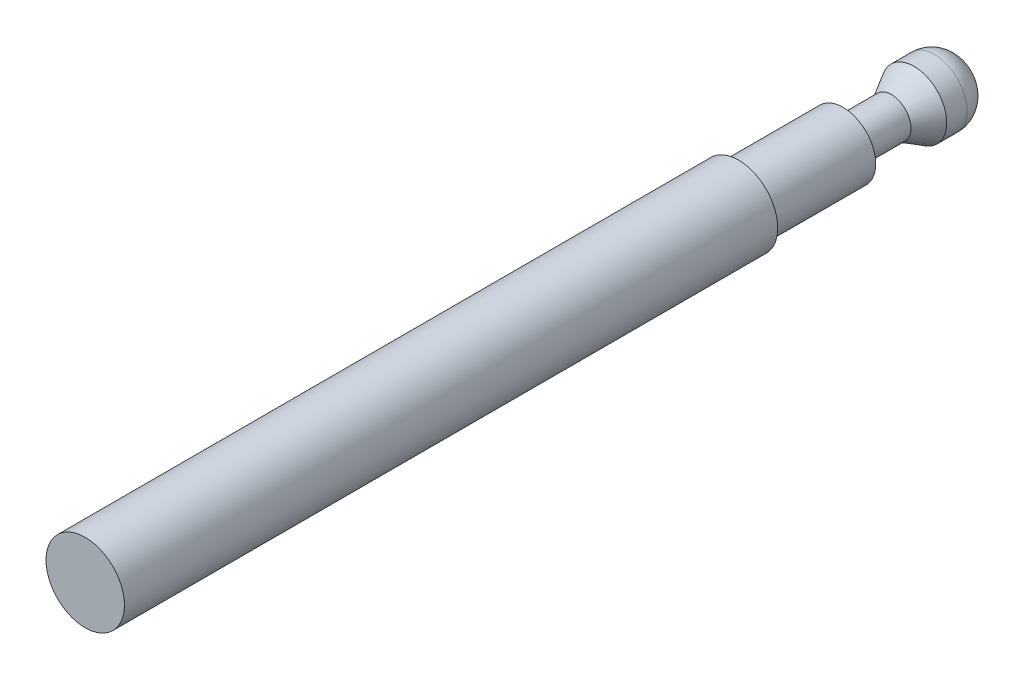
ISO-10303-21;
HEADER;
FILE_DESCRIPTION(('STEP AP214'),'2;1');
FILE_NAME('part.step','',(''),(''),'','','');
FILE_SCHEMA(('AUTOMOTIVE_DESIGN { 1 0 10303 214 1 1 1 1 }'));
ENDSEC;
DATA;
#1=APPLICATION_CONTEXT('core data for automotive mechanical design processes');
#2=APPLICATION_PROTOCOL_DEFINITION('international standard','automotive_design',2000,#1);
#3=PRODUCT_CONTEXT('',#1,'mechanical');
#4=PRODUCT('Part','Part','',(#3));
#5=PRODUCT_RELATED_PRODUCT_CATEGORY('part','',(#4));
#6=PRODUCT_DEFINITION_FORMATION('','',#4);
#7=PRODUCT_DEFINITION_CONTEXT('part definition',#1,'design');
#8=PRODUCT_DEFINITION('design','',#6,#7);
#9=PRODUCT_DEFINITION_SHAPE('','',#8);
#10=(LENGTH_UNIT() NAMED_UNIT(*) SI_UNIT(.MILLI.,.METRE.));
#11=(NAMED_UNIT(*) PLANE_ANGLE_UNIT() SI_UNIT($,.RADIAN.));
#12=(NAMED_UNIT(*) SI_UNIT($,.STERADIAN.) SOLID_ANGLE_UNIT());
#13=UNCERTAINTY_MEASURE_WITH_UNIT(LENGTH_MEASURE(1.E-05),#10,'distance_accuracy_value','');
#14=(GEOMETRIC_REPRESENTATION_CONTEXT(3) GLOBAL_UNCERTAINTY_ASSIGNED_CONTEXT((#13)) GLOBAL_UNIT_ASSIGNED_CONTEXT((#10,
#11,#12)) REPRESENTATION_CONTEXT('',''));
#15=CARTESIAN_POINT('',(0.,0.,0.));
#16=DIRECTION('',(0.,0.,1.));
#17=DIRECTION('',(1.,0.,0.));
#18=AXIS2_PLACEMENT_3D('',#15,#16,#17);
#19=CARTESIAN_POINT('',(0.,0.,-50.));
#20=DIRECTION('',(0.,0.,-1.));
#21=DIRECTION('',(0.,-1.,0.));
#22=AXIS2_PLACEMENT_3D('',#19,#20,#21);
#23=CYLINDRICAL_SURFACE('',#22,1.5);
#24=CARTESIAN_POINT('',(0.,0.,-58.));
#25=DIRECTION('',(0.,0.,-1.));
#26=DIRECTION('',(0.,-1.,0.));
#27=AXIS2_PLACEMENT_3D('',#24,#25,#26);
#28=CIRCLE('',#27,1.5);
#29=CARTESIAN_POINT('',(0.,-1.5,-58.));
#30=VERTEX_POINT('',#29);
#31=EDGE_CURVE('E34',#30,#30,#28,.T.);
#32=ORIENTED_EDGE('',*,*,#31,.T.);
#33=EDGE_LOOP('',(#32));
#34=FACE_BOUND('',#33,.T.);
#35=CARTESIAN_POINT('',(0.,0.,-61.7));
#36=DIRECTION('',(0.,0.,-1.));
#37=DIRECTION('',(0.,-1.,0.));
#38=AXIS2_PLACEMENT_3D('',#35,#36,#37);
#39=CIRCLE('',#38,1.5);
#40=CARTESIAN_POINT('',(0.,-1.5,-61.7));
#41=VERTEX_POINT('',#40);
#42=EDGE_CURVE('E22',#41,#41,#39,.T.);
#43=ORIENTED_EDGE('',*,*,#42,.F.);
#44=EDGE_LOOP('',(#43));
#45=FACE_BOUND('',#44,.T.);
#46=ADVANCED_FACE('F12',(#34,#45),#23,.T.);
#47=CARTESIAN_POINT('',(0.,0.,-63.4320508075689));
#48=DIRECTION('',(0.,0.,-1.));
#49=DIRECTION('',(0.,-1.,0.));
#50=AXIS2_PLACEMENT_3D('',#47,#48,#49);
#51=CONICAL_SURFACE('',#50,2.5,0.523598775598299);
#52=ORIENTED_EDGE('',*,*,#42,.T.);
#53=EDGE_LOOP('',(#52));
#54=FACE_BOUND('',#53,.T.);
#55=CARTESIAN_POINT('',(0.,0.,-63.4320508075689));
#56=DIRECTION('',(0.,0.,-1.));
#57=DIRECTION('',(0.,-1.,0.));
#58=AXIS2_PLACEMENT_3D('',#55,#56,#57);
#59=CIRCLE('',#58,2.5);
#60=CARTESIAN_POINT('',(0.,-2.5,-63.4320508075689));
#61=VERTEX_POINT('',#60);
#62=EDGE_CURVE('E26',#61,#61,#59,.T.);
#63=ORIENTED_EDGE('',*,*,#62,.F.);
#64=EDGE_LOOP('',(#63));
#65=FACE_BOUND('',#64,.T.);
#66=ADVANCED_FACE('F62',(#54,#65),#51,.T.);
#67=CARTESIAN_POINT('',(0.,0.,-50.));
#68=DIRECTION('',(0.,0.,-1.));
#69=DIRECTION('',(0.,-1.,0.));
#70=AXIS2_PLACEMENT_3D('',#67,#68,#69);
#71=CYLINDRICAL_SURFACE('',#70,2.5);
#72=CARTESIAN_POINT('',(0.,0.,-65.));
#73=DIRECTION('',(0.,0.,-1.));
#74=DIRECTION('',(0.,-1.,0.));
#75=AXIS2_PLACEMENT_3D('',#72,#73,#74);
#76=CIRCLE('',#75,2.5);
#77=CARTESIAN_POINT('',(0.,-2.5,-65.));
#78=VERTEX_POINT('',#77);
#79=EDGE_CURVE('E8',#78,#78,#76,.F.);
#80=ORIENTED_EDGE('',*,*,#79,.T.);
#81=EDGE_LOOP('',(#80));
#82=FACE_BOUND('',#81,.T.);
#83=ORIENTED_EDGE('',*,*,#62,.T.);
#84=EDGE_LOOP('',(#83));
#85=FACE_BOUND('',#84,.T.);
#86=ADVANCED_FACE('F68',(#82,#85),#71,.T.);
#87=CARTESIAN_POINT('',(-2.5,0.,-67.));
#88=DIRECTION('',(0.,0.,-1.));
#89=DIRECTION('',(0.,-1.,0.));
#90=AXIS2_PLACEMENT_3D('',#87,#88,#89);
#91=PLANE('',#90);
#92=CARTESIAN_POINT('',(0.,0.,-67.));
#93=DIRECTION('',(0.,0.,-1.));
#94=DIRECTION('',(0.,-1.,0.));
#95=AXIS2_PLACEMENT_3D('',#92,#93,#94);
#96=CIRCLE('',#95,0.5);
#97=CARTESIAN_POINT('',(0.,-0.499999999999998,-67.));
#98=VERTEX_POINT('',#97);
#99=EDGE_CURVE('E18',#98,#98,#96,.T.);
#100=ORIENTED_EDGE('',*,*,#99,.T.);
#101=EDGE_LOOP('',(#100));
#102=FACE_BOUND('',#101,.T.);
#103=ADVANCED_FACE('F77',(#102),#91,.T.);
#104=CARTESIAN_POINT('',(0.,0.,-50.));
#105=DIRECTION('',(0.,0.,-1.));
#106=DIRECTION('',(0.,-1.,0.));
#107=AXIS2_PLACEMENT_3D('',#104,#105,#106);
#108=CYLINDRICAL_SURFACE('',#107,2.5);
#109=CARTESIAN_POINT('',(0.,0.,-50.));
#110=DIRECTION('',(0.,0.,1.));
#111=DIRECTION('',(1.,0.,0.));
#112=AXIS2_PLACEMENT_3D('',#109,#110,#111);
#113=CIRCLE('',#112,2.5);
#114=CARTESIAN_POINT('',(2.5,0.,-50.));
#115=VERTEX_POINT('',#114);
#116=EDGE_CURVE('E37',#115,#115,#113,.F.);
#117=ORIENTED_EDGE('',*,*,#116,.T.);
#118=EDGE_LOOP('',(#117));
#119=FACE_BOUND('',#118,.T.);
#120=CARTESIAN_POINT('',(0.,0.,-58.));
#121=DIRECTION('',(0.,0.,-1.));
#122=DIRECTION('',(0.,-1.,0.));
#123=AXIS2_PLACEMENT_3D('',#120,#121,#122);
#124=CIRCLE('',#123,2.5);
#125=CARTESIAN_POINT('',(0.,-2.5,-58.));
#126=VERTEX_POINT('',#125);
#127=EDGE_CURVE('E31',#126,#126,#124,.T.);
#128=ORIENTED_EDGE('',*,*,#127,.F.);
#129=EDGE_LOOP('',(#128));
#130=FACE_BOUND('',#129,.T.);
#131=ADVANCED_FACE('F83',(#119,#130),#108,.T.);
#132=CARTESIAN_POINT('',(-2.5,0.,-58.));
#133=DIRECTION('',(0.,0.,-1.));
#134=DIRECTION('',(0.,-1.,0.));
#135=AXIS2_PLACEMENT_3D('',#132,#133,#134);
#136=PLANE('',#135);
#137=ORIENTED_EDGE('',*,*,#127,.T.);
#138=EDGE_LOOP('',(#137));
#139=FACE_BOUND('',#138,.T.);
#140=ORIENTED_EDGE('',*,*,#31,.F.);
#141=EDGE_LOOP('',(#140));
#142=FACE_BOUND('',#141,.T.);
#143=ADVANCED_FACE('F88',(#139,#142),#136,.T.);
#144=CARTESIAN_POINT('',(0.,0.,-65.));
#145=DIRECTION('',(0.,0.,-1.));
#146=DIRECTION('',(0.,-1.,0.));
#147=AXIS2_PLACEMENT_3D('',#144,#145,#146);
#148=DEGENERATE_TOROIDAL_SURFACE('',#147,0.5,2.,.T.);
#149=ORIENTED_EDGE('',*,*,#79,.F.);
#150=EDGE_LOOP('',(#149));
#151=FACE_BOUND('',#150,.T.);
#152=ORIENTED_EDGE('',*,*,#99,.F.);
#153=EDGE_LOOP('',(#152));
#154=FACE_BOUND('',#153,.T.);
#155=ADVANCED_FACE('F92',(#151,#154),#148,.T.);
#156=CARTESIAN_POINT('',(0.,0.,0.));
#157=DIRECTION('',(0.,0.,-1.));
#158=DIRECTION('',(-1.,0.,0.));
#159=AXIS2_PLACEMENT_3D('',#156,#157,#158);
#160=CYLINDRICAL_SURFACE('',#159,3.);
#161=CARTESIAN_POINT('',(0.,0.,0.));
#162=DIRECTION('',(0.,0.,-1.));
#163=DIRECTION('',(-1.,0.,0.));
#164=AXIS2_PLACEMENT_3D('',#161,#162,#163);
#165=CIRCLE('',#164,3.);
#166=CARTESIAN_POINT('',(-3.,0.,0.));
#167=VERTEX_POINT('',#166);
#168=EDGE_CURVE('E43',#167,#167,#165,.T.);
#169=ORIENTED_EDGE('',*,*,#168,.T.);
#170=EDGE_LOOP('',(#169));
#171=FACE_BOUND('',#170,.T.);
#172=CARTESIAN_POINT('',(0.,0.,-50.));
#173=DIRECTION('',(0.,0.,1.));
#174=DIRECTION('',(1.,0.,0.));
#175=AXIS2_PLACEMENT_3D('',#172,#173,#174);
#176=CIRCLE('',#175,3.);
#177=CARTESIAN_POINT('',(3.,0.,-50.));
#178=VERTEX_POINT('',#177);
#179=EDGE_CURVE('E40',#178,#178,#176,.T.);
#180=ORIENTED_EDGE('',*,*,#179,.T.);
#181=EDGE_LOOP('',(#180));
#182=FACE_BOUND('',#181,.T.);
#183=ADVANCED_FACE('F47',(#171,#182),#160,.T.);
#184=CARTESIAN_POINT('',(0.,0.,-50.));
#185=DIRECTION('',(0.,0.,1.));
#186=DIRECTION('',(1.,0.,0.));
#187=AXIS2_PLACEMENT_3D('',#184,#185,#186);
#188=PLANE('',#187);
#189=ORIENTED_EDGE('',*,*,#116,.F.);
#190=EDGE_LOOP('',(#189));
#191=FACE_BOUND('',#190,.T.);
#192=ORIENTED_EDGE('',*,*,#179,.F.);
#193=EDGE_LOOP('',(#192));
#194=FACE_BOUND('',#193,.T.);
#195=ADVANCED_FACE('F52',(#191,#194),#188,.F.);
#196=CARTESIAN_POINT('',(0.,0.,0.));
#197=DIRECTION('',(0.,0.,-1.));
#198=DIRECTION('',(-1.,0.,0.));
#199=AXIS2_PLACEMENT_3D('',#196,#197,#198);
#200=PLANE('',#199);
#201=ORIENTED_EDGE('',*,*,#168,.F.);
#202=EDGE_LOOP('',(#201));
#203=FACE_BOUND('',#202,.T.);
#204=ADVANCED_FACE('F50',(#203),#200,.F.);
#205=CLOSED_SHELL('',(#46,#66,#86,#103,#131,#143,#155,#183,#195,#204));
#206=MANIFOLD_SOLID_BREP('B1',#205);
#207=ADVANCED_BREP_SHAPE_REPRESENTATION('',(#18,#206),#14);
#208=SHAPE_DEFINITION_REPRESENTATION(#9,#207);
ENDSEC;
END-ISO-10303-21;
